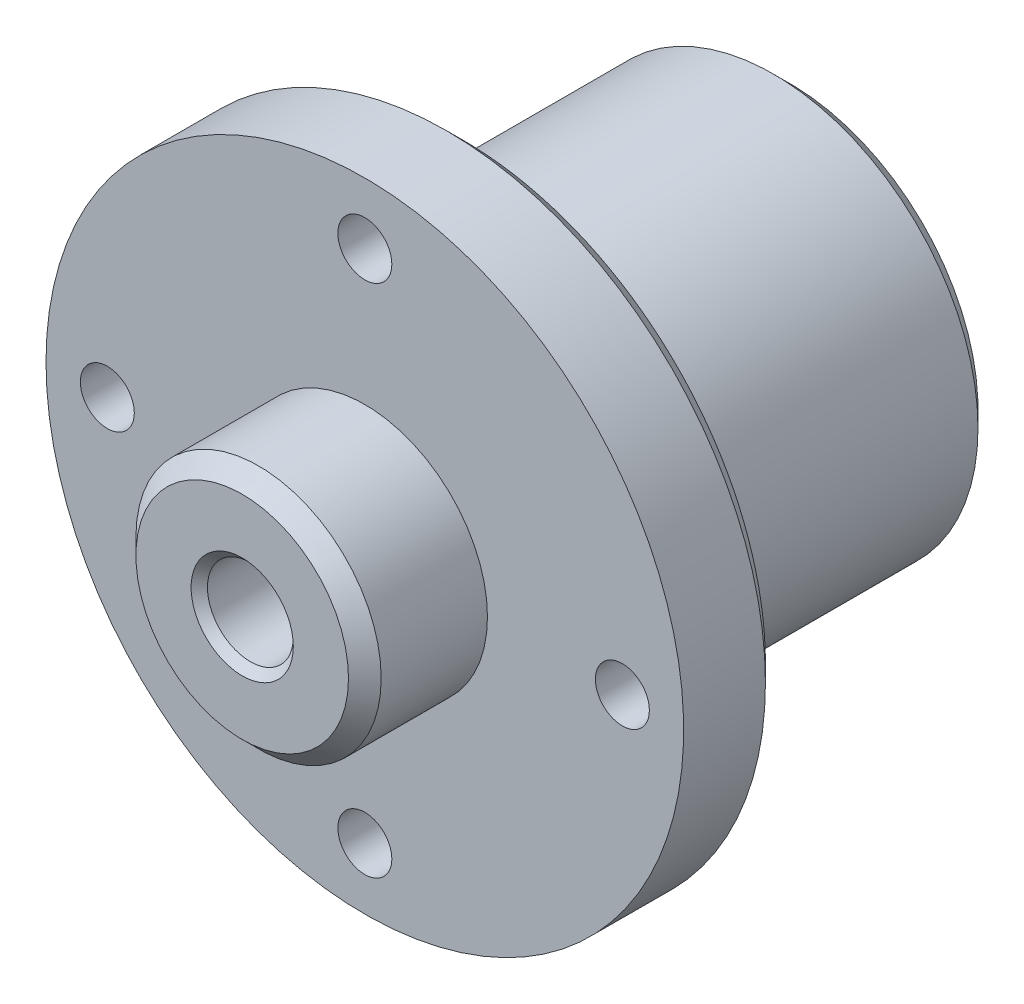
from build123d import *

# Parameters (mm, degrees)
CHANF_2_SIZE         = 2
CHANF_1_SIZE         = 1
FIXATION_D           = 6.6
FIXATION_CBORE_D     = 11
FIXATION_CBORE_DEPTH = 6


with BuildPart() as part:
    # Esquisse1 → Corps (revolve)
    with BuildSketch(Plane(origin=(0, 0, 0), x_dir=(1, 0, 0), z_dir=(0, 1, 0))):
        Polygon((-5.25, 52), (-25, 52), (-25, 12), (-39, 12), (-39, 0), (-15, 0), (-15, -15), (-5.25, -15), align=None)
    revolve(axis=Axis((0, 0, -54.697354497), (0, 0, 1)))

    # Chanf 2
    chanf_2_edges = [part.edges().sort_by_distance(p)[0] for p in [
        (25, 0, -52),
        (39, 0, -12),
        (15, 0, 15),
    ]]
    chamfer(chanf_2_edges, length=CHANF_2_SIZE)

    # Chanf 1
    chanf_1_edges = [part.edges().sort_by_distance(p)[0] for p in [
        (5.25, 0, -52),
        (5.25, 0, 15),
    ]]
    chamfer(chanf_1_edges, length=CHANF_1_SIZE)

    # Fixation (through all)
    with Locations(Plane(origin=(0, 0, -12), x_dir=(-1, 0, 0), z_dir=(0, 0, -1))):
        with Locations((0, 31.5), (-31.5, 0), (31.5, 0), (0, -31.5)):
            CounterBoreHole(FIXATION_D / 2, FIXATION_CBORE_D / 2, FIXATION_CBORE_DEPTH)


solid = part.part
